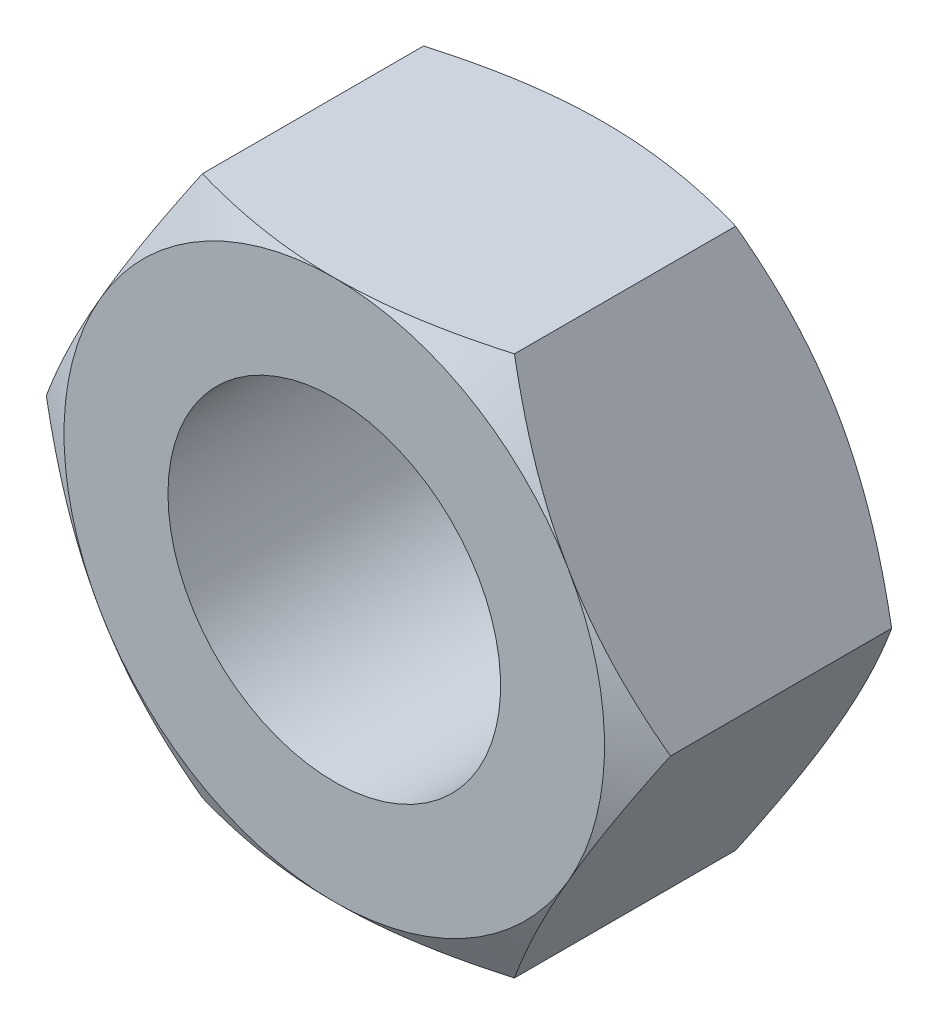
from build123d import *

# Parameters (mm, degrees)
ESQUISSE1_R             = 4
BASE_EXTRUSION_DEPTH    = 6.5
ESQUISSE2_R             = 8.952008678
ESQUISSE2_R_2           = 6.467036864
ENL_V_MAT_EXTRU_1_DEPTH = 5
ENL_V_MAT_EXTRU_1_TAPER = 60
ESQUISSE3_R             = 9.119331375
ESQUISSE3_R_2           = 6.5
ENL_V_MAT_EXTRU_2_DEPTH = 5
ENL_V_MAT_EXTRU_2_TAPER = 60


with BuildPart() as part:
    # Esquisse1 → Base-Extrusion (new body)
    with BuildSketch(Plane.XY):
        Polygon((-3.75277675, -6.5), (-7.505553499, 0), (-3.75277675, 6.5), (3.75277675, 6.5), (7.505553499, 0), (3.75277675, -6.5), align=None)
        with Locations(Location((0, 0, 0), (0, 0, 180))):
            Circle(ESQUISSE1_R, mode=Mode.SUBTRACT)
    extrude(amount=BASE_EXTRUSION_DEPTH)

    # Esquisse2 → Enl_v. mat.-Extru.1 (cut)
    with BuildSketch(Plane(origin=(0, 0, 0), x_dir=(-1, 0, 0), z_dir=(0, 0, -1))):
        Circle(ESQUISSE2_R)
        Circle(ESQUISSE2_R_2, mode=Mode.SUBTRACT)
    extrude(amount=-ENL_V_MAT_EXTRU_1_DEPTH, taper=ENL_V_MAT_EXTRU_1_TAPER, mode=Mode.SUBTRACT)

    # Esquisse3 → Enl_v. mat.-Extru.2 (cut)
    with BuildSketch(Plane.XY.offset(6.5)):
        Circle(ESQUISSE3_R)
        Circle(ESQUISSE3_R_2, mode=Mode.SUBTRACT)
    extrude(amount=-ENL_V_MAT_EXTRU_2_DEPTH, taper=ENL_V_MAT_EXTRU_2_TAPER, mode=Mode.SUBTRACT)


solid = part.part
